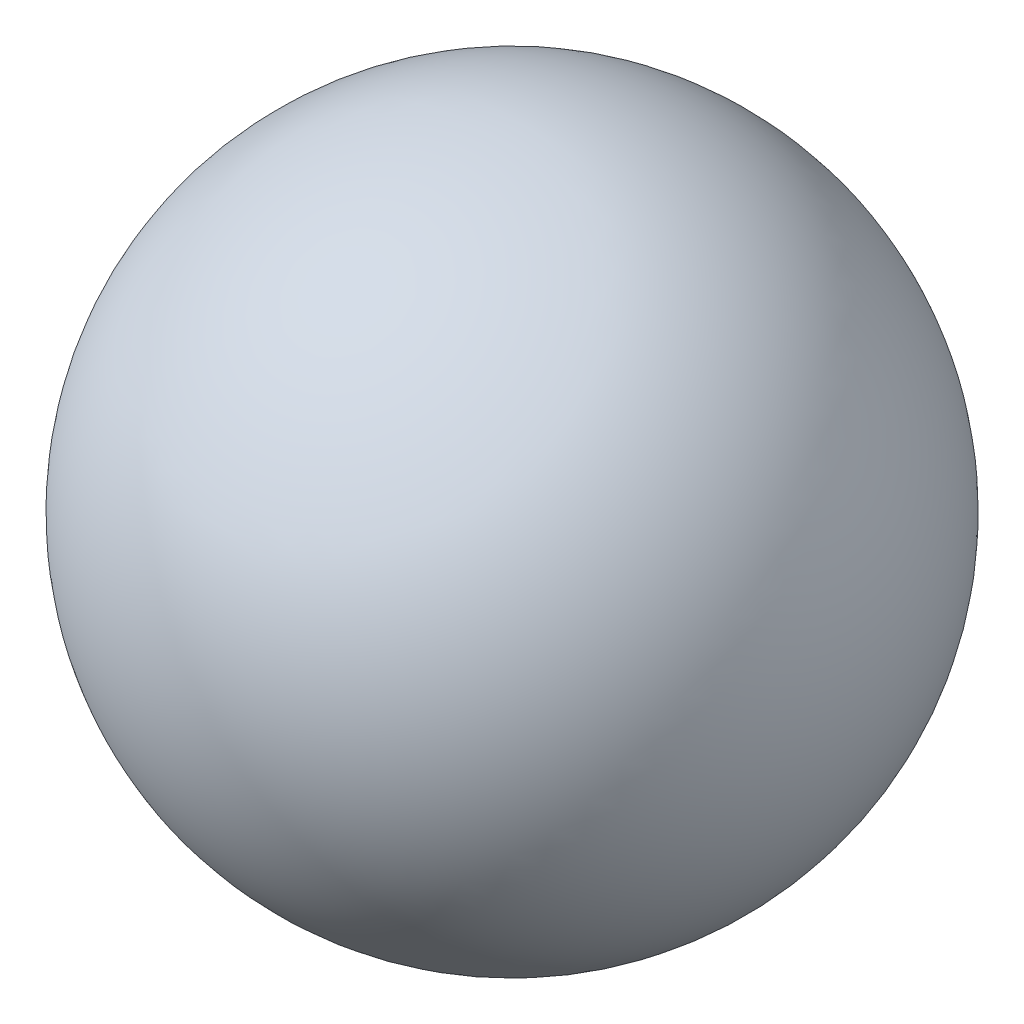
from build123d import *


with BuildPart() as part:
    # Skizze2 → Rotation2 (revolve)
    with BuildSketch(Plane(origin=(0, 0, 0), x_dir=(1, 0, 0), z_dir=(0, 1, 0))):
        with BuildLine():
            Line((0, 10), (0, -10))
            ThreePointArc((0, -10), (-10, 0), (0, 10))
        make_face()
    revolve(axis=Axis((0, 0, 0), (0, 0, -1)))


solid = part.part
